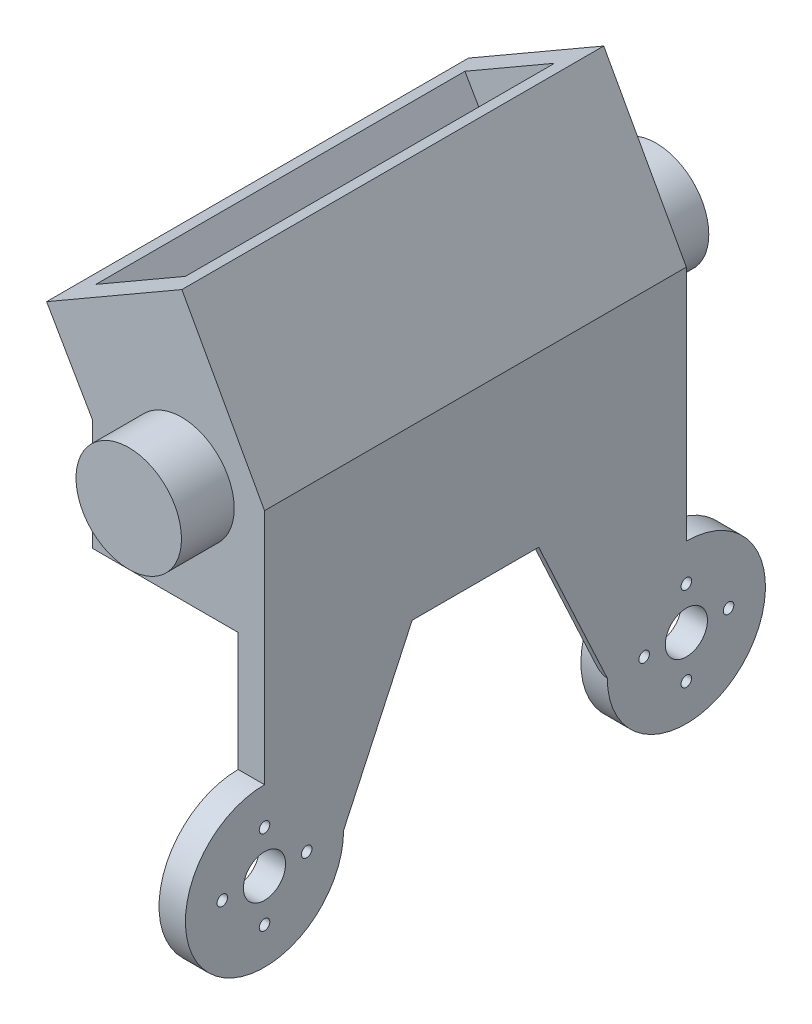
ISO-10303-21;
HEADER;
FILE_DESCRIPTION(('STEP AP214'),'2;1');
FILE_NAME('part.step','',(''),(''),'','','');
FILE_SCHEMA(('AUTOMOTIVE_DESIGN { 1 0 10303 214 1 1 1 1 }'));
ENDSEC;
DATA;
#1=APPLICATION_CONTEXT('core data for automotive mechanical design processes');
#2=APPLICATION_PROTOCOL_DEFINITION('international standard','automotive_design',2000,#1);
#3=PRODUCT_CONTEXT('',#1,'mechanical');
#4=PRODUCT('Part','Part','',(#3));
#5=PRODUCT_RELATED_PRODUCT_CATEGORY('part','',(#4));
#6=PRODUCT_DEFINITION_FORMATION('','',#4);
#7=PRODUCT_DEFINITION_CONTEXT('part definition',#1,'design');
#8=PRODUCT_DEFINITION('design','',#6,#7);
#9=PRODUCT_DEFINITION_SHAPE('','',#8);
#10=(LENGTH_UNIT() NAMED_UNIT(*) SI_UNIT(.MILLI.,.METRE.));
#11=(NAMED_UNIT(*) PLANE_ANGLE_UNIT() SI_UNIT($,.RADIAN.));
#12=(NAMED_UNIT(*) SI_UNIT($,.STERADIAN.) SOLID_ANGLE_UNIT());
#13=UNCERTAINTY_MEASURE_WITH_UNIT(LENGTH_MEASURE(1.E-05),#10,'distance_accuracy_value','');
#14=(GEOMETRIC_REPRESENTATION_CONTEXT(3) GLOBAL_UNCERTAINTY_ASSIGNED_CONTEXT((#13)) GLOBAL_UNIT_ASSIGNED_CONTEXT((#10,
#11,#12)) REPRESENTATION_CONTEXT('',''));
#15=CARTESIAN_POINT('',(0.,0.,0.));
#16=DIRECTION('',(0.,0.,1.));
#17=DIRECTION('',(1.,0.,0.));
#18=AXIS2_PLACEMENT_3D('',#15,#16,#17);
#19=CARTESIAN_POINT('',(0.,0.,0.));
#20=DIRECTION('',(1.,0.,0.));
#21=DIRECTION('',(0.,0.,-1.));
#22=AXIS2_PLACEMENT_3D('',#19,#20,#21);
#23=PLANE('',#22);
#24=DIRECTION('',(0.,-1.,0.));
#25=VECTOR('',#24,1.);
#26=CARTESIAN_POINT('',(0.,61.,-75.));
#27=LINE('',#26,#25);
#28=CARTESIAN_POINT('',(0.,61.,-75.));
#29=VERTEX_POINT('',#28);
#30=CARTESIAN_POINT('',(0.,60.0000000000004,-75.));
#31=VERTEX_POINT('',#30);
#32=EDGE_CURVE('E263',#29,#31,#27,.T.);
#33=ORIENTED_EDGE('',*,*,#32,.T.);
#34=DIRECTION('',(0.,0.,1.));
#35=VECTOR('',#34,1.);
#36=CARTESIAN_POINT('',(0.,60.0000000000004,0.));
#37=LINE('',#36,#35);
#38=CARTESIAN_POINT('',(0.,60.0000000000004,-4.99999999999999));
#39=VERTEX_POINT('',#38);
#40=EDGE_CURVE('E231',#31,#39,#37,.T.);
#41=ORIENTED_EDGE('',*,*,#40,.T.);
#42=DIRECTION('',(0.,-1.,0.));
#43=VECTOR('',#42,1.);
#44=CARTESIAN_POINT('',(0.,61.,-4.99999999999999));
#45=LINE('',#44,#43);
#46=CARTESIAN_POINT('',(0.,61.,-4.99999999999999));
#47=VERTEX_POINT('',#46);
#48=EDGE_CURVE('E203',#47,#39,#45,.T.);
#49=ORIENTED_EDGE('',*,*,#48,.F.);
#50=DIRECTION('',(0.,0.,1.));
#51=VECTOR('',#50,1.);
#52=CARTESIAN_POINT('',(0.,61.,-75.));
#53=LINE('',#52,#51);
#54=EDGE_CURVE('E243',#29,#47,#53,.T.);
#55=ORIENTED_EDGE('',*,*,#54,.F.);
#56=EDGE_LOOP('',(#33,#41,#49,#55));
#57=FACE_BOUND('',#56,.T.);
#58=ADVANCED_FACE('F37',(#57),#23,.F.);
#59=CARTESIAN_POINT('',(5.,0.,-80.));
#60=DIRECTION('',(-1.,0.,0.));
#61=DIRECTION('',(0.,0.,1.));
#62=AXIS2_PLACEMENT_3D('',#59,#60,#61);
#63=CYLINDRICAL_SURFACE('',#62,15.);
#64=CARTESIAN_POINT('',(0.,0.,-80.));
#65=DIRECTION('',(1.,0.,0.));
#66=DIRECTION('',(0.,0.,-1.));
#67=AXIS2_PLACEMENT_3D('',#64,#65,#66);
#68=CIRCLE('',#67,15.);
#69=CARTESIAN_POINT('',(0.,7.52000918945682,-67.0211918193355));
#70=VERTEX_POINT('',#69);
#71=CARTESIAN_POINT('',(0.,15.,-80.));
#72=VERTEX_POINT('',#71);
#73=EDGE_CURVE('E310',#70,#72,#68,.T.);
#74=ORIENTED_EDGE('',*,*,#73,.T.);
#75=DIRECTION('',(-1.,0.,0.));
#76=VECTOR('',#75,1.);
#77=CARTESIAN_POINT('',(5.,15.,-80.));
#78=LINE('',#77,#76);
#79=CARTESIAN_POINT('',(5.,15.,-80.));
#80=VERTEX_POINT('',#79);
#81=EDGE_CURVE('E346',#80,#72,#78,.T.);
#82=ORIENTED_EDGE('',*,*,#81,.F.);
#83=CARTESIAN_POINT('',(5.,0.,-80.));
#84=DIRECTION('',(1.,0.,0.));
#85=DIRECTION('',(0.,0.,-1.));
#86=AXIS2_PLACEMENT_3D('',#83,#84,#85);
#87=CIRCLE('',#86,15.);
#88=CARTESIAN_POINT('',(5.,0.,-65.));
#89=VERTEX_POINT('',#88);
#90=EDGE_CURVE('E311',#89,#80,#87,.T.);
#91=ORIENTED_EDGE('',*,*,#90,.F.);
#92=CARTESIAN_POINT('',(5.,0.,-65.));
#93=CARTESIAN_POINT('',(4.93154830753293,-4.38672861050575E-05,-65.0000043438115));
#94=CARTESIAN_POINT('',(4.8631235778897,0.00333661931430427,-65.0000000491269));
#95=CARTESIAN_POINT('',(4.72702251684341,0.0166023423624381,-65.0000065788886));
#96=CARTESIAN_POINT('',(4.65934509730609,0.0264763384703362,-65.0000173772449));
#97=CARTESIAN_POINT('',(4.52621391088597,0.0521900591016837,-65.0000857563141));
#98=CARTESIAN_POINT('',(4.46074197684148,0.0679366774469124,-65.0001426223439));
#99=CARTESIAN_POINT('',(4.33133995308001,0.104867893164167,-65.0003550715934));
#100=CARTESIAN_POINT('',(4.26741062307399,0.126055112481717,-65.0005107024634));
#101=CARTESIAN_POINT('',(4.0356766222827,0.212892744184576,-65.0013786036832));
#102=CARTESIAN_POINT('',(3.87340619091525,0.293536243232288,-65.0025866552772));
#103=CARTESIAN_POINT('',(3.56248540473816,0.478941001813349,-65.0073603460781));
#104=CARTESIAN_POINT('',(3.41394529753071,0.583877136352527,-65.0109434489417));
#105=CARTESIAN_POINT('',(3.14078631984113,0.801072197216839,-65.0210405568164));
#106=CARTESIAN_POINT('',(3.01520668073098,0.91215508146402,-65.0273091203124));
#107=CARTESIAN_POINT('',(2.7736359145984,1.14415523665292,-65.0432473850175));
#108=CARTESIAN_POINT('',(2.65765304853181,1.26508080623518,-65.0529199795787));
#109=CARTESIAN_POINT('',(2.43400257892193,1.51432816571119,-65.0761093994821));
#110=CARTESIAN_POINT('',(2.32634802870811,1.64266103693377,-65.0896321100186));
#111=CARTESIAN_POINT('',(2.11866153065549,1.90488567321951,-65.1208577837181));
#112=CARTESIAN_POINT('',(2.01863182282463,2.03877905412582,-65.1385619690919));
#113=CARTESIAN_POINT('',(1.76658293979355,2.39411463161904,-65.1906364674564));
#114=CARTESIAN_POINT('',(1.62016901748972,2.61903402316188,-65.2285784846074));
#115=CARTESIAN_POINT('',(1.34437542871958,3.07678232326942,-65.3170894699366));
#116=CARTESIAN_POINT('',(1.21500439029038,3.30961516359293,-65.3676647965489));
#117=CARTESIAN_POINT('',(0.973668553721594,3.78016525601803,-65.4821205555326));
#118=CARTESIAN_POINT('',(0.8616585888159,4.01786794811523,-65.5459654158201));
#119=CARTESIAN_POINT('',(0.655501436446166,4.49678703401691,-65.6877235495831));
#120=CARTESIAN_POINT('',(0.561351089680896,4.73800279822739,-65.7656343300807));
#121=CARTESIAN_POINT('',(0.402811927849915,5.19250196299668,-65.9256027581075));
#122=CARTESIAN_POINT('',(0.336191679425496,5.40559433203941,-66.0059884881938));
#123=CARTESIAN_POINT('',(0.219429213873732,5.8316158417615,-66.1780968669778));
#124=CARTESIAN_POINT('',(0.169278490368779,6.0445450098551,-66.2698136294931));
#125=CARTESIAN_POINT('',(0.0870085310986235,6.46994695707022,-66.4650531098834));
#126=CARTESIAN_POINT('',(0.0549837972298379,6.68241169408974,-66.5686343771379));
#127=CARTESIAN_POINT('',(0.022353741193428,6.99861228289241,-66.7322356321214));
#128=CARTESIAN_POINT('',(0.0140443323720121,7.10369819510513,-66.7881998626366));
#129=CARTESIAN_POINT('',(0.00286770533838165,7.31275611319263,-66.9027552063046));
#130=CARTESIAN_POINT('',(1.96588662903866E-06,7.4167278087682,-66.9613470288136));
#131=CARTESIAN_POINT('',(0.,7.52000918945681,-67.0211918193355));
#132=B_SPLINE_CURVE_WITH_KNOTS('',3,(#92,#93,#94,#95,#96,#97,#98,#99,#100,#101,#102,#103,#104,
#105,#106,#107,#108,#109,#110,#111,#112,#113,#114,#115,#116,#117,#118,#119,#120,#121,#122,#123,
#124,#125,#126,#127,#128,#129,#130,#131),.UNSPECIFIED.,.F.,.F.,(4,2,2,2,2,2,2,2,2,2,2,2,2,2,2,2,
2,2,2,4),(0.,0.205228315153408,0.410102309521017,0.611857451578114,0.813710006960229,
1.3539649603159,1.89823711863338,2.40083205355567,2.90385521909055,3.40765146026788,
3.91159513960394,4.7236464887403,5.53610737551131,6.34641773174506,7.15658461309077,
7.86768828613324,8.57842410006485,9.29283206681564,9.6507385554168,10.0087422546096),.UNSPECIFIED.);
#133=EDGE_CURVE('E380',#89,#70,#132,.T.);
#134=ORIENTED_EDGE('',*,*,#133,.T.);
#135=EDGE_LOOP('',(#74,#82,#91,#134));
#136=FACE_BOUND('',#135,.T.);
#137=ADVANCED_FACE('F374',(#136),#63,.T.);
#138=CARTESIAN_POINT('',(5.,0.,-80.));
#139=DIRECTION('',(0.,0.,1.));
#140=DIRECTION('',(1.,0.,0.));
#141=AXIS2_PLACEMENT_3D('',#138,#139,#140);
#142=PLANE('',#141);
#143=CARTESIAN_POINT('',(-10.7449740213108,57.5,-80.));
#144=DIRECTION('',(0.,0.,1.));
#145=DIRECTION('',(1.,0.,0.));
#146=AXIS2_PLACEMENT_3D('',#143,#144,#145);
#147=CIRCLE('',#146,10.);
#148=CARTESIAN_POINT('',(-0.744974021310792,57.5,-80.));
#149=VERTEX_POINT('',#148);
#150=EDGE_CURVE('E352',#149,#149,#147,.F.);
#151=ORIENTED_EDGE('',*,*,#150,.F.);
#152=EDGE_LOOP('',(#151));
#153=FACE_BOUND('',#152,.T.);
#154=DIRECTION('',(0.,1.,0.));
#155=VECTOR('',#154,1.);
#156=CARTESIAN_POINT('',(0.,0.,-80.));
#157=LINE('',#156,#155);
#158=CARTESIAN_POINT('',(0.,37.5,-80.));
#159=VERTEX_POINT('',#158);
#160=EDGE_CURVE('E338',#72,#159,#157,.T.);
#161=ORIENTED_EDGE('',*,*,#160,.T.);
#162=DIRECTION('',(-1.,0.,0.));
#163=VECTOR('',#162,1.);
#164=CARTESIAN_POINT('',(0.,37.5,-80.));
#165=LINE('',#164,#163);
#166=CARTESIAN_POINT('',(-27.655685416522,37.5,-80.));
#167=VERTEX_POINT('',#166);
#168=EDGE_CURVE('E260',#159,#167,#165,.T.);
#169=ORIENTED_EDGE('',*,*,#168,.T.);
#170=DIRECTION('',(0.,1.,0.));
#171=VECTOR('',#170,1.);
#172=CARTESIAN_POINT('',(-27.655685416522,37.5,-80.));
#173=LINE('',#172,#171);
#174=CARTESIAN_POINT('',(-27.655685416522,58.6605665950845,-80.));
#175=VERTEX_POINT('',#174);
#176=EDGE_CURVE('E281',#167,#175,#173,.T.);
#177=ORIENTED_EDGE('',*,*,#176,.T.);
#178=DIRECTION('',(-0.5,0.866025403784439,0.));
#179=VECTOR('',#178,1.);
#180=CARTESIAN_POINT('',(-27.655685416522,58.6605665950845,-80.));
#181=LINE('',#180,#179);
#182=CARTESIAN_POINT('',(-36.3217557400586,73.6706406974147,-80.));
#183=VERTEX_POINT('',#182);
#184=EDGE_CURVE('E272',#175,#183,#181,.T.);
#185=ORIENTED_EDGE('',*,*,#184,.T.);
#186=DIRECTION('',(0.86602540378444,0.499999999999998,0.));
#187=VECTOR('',#186,1.);
#188=CARTESIAN_POINT('',(-15.,85.9807621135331,-80.));
#189=LINE('',#188,#187);
#190=CARTESIAN_POINT('',(-10.6698729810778,88.4807621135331,-80.));
#191=VERTEX_POINT('',#190);
#192=EDGE_CURVE('E289',#183,#191,#189,.T.);
#193=ORIENTED_EDGE('',*,*,#192,.T.);
#194=DIRECTION('',(0.482047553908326,-0.876145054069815,0.));
#195=VECTOR('',#194,1.);
#196=CARTESIAN_POINT('',(-10.6698729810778,88.4807621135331,-80.));
#197=LINE('',#196,#195);
#198=CARTESIAN_POINT('',(5.,60.,-80.));
#199=VERTEX_POINT('',#198);
#200=EDGE_CURVE('E301',#191,#199,#197,.T.);
#201=ORIENTED_EDGE('',*,*,#200,.T.);
#202=DIRECTION('',(0.,1.,0.));
#203=VECTOR('',#202,1.);
#204=CARTESIAN_POINT('',(5.,0.,-80.));
#205=LINE('',#204,#203);
#206=EDGE_CURVE('E314',#80,#199,#205,.T.);
#207=ORIENTED_EDGE('',*,*,#206,.F.);
#208=ORIENTED_EDGE('',*,*,#81,.T.);
#209=EDGE_LOOP('',(#161,#169,#177,#185,#193,#201,#207,#208));
#210=FACE_BOUND('',#209,.T.);
#211=ADVANCED_FACE('F436',(#153,#210),#142,.F.);
#212=CARTESIAN_POINT('',(5.,0.,0.));
#213=DIRECTION('',(0.,0.,1.));
#214=DIRECTION('',(1.,0.,0.));
#215=AXIS2_PLACEMENT_3D('',#212,#213,#214);
#216=PLANE('',#215);
#217=CARTESIAN_POINT('',(-10.7449740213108,57.5,0.));
#218=DIRECTION('',(0.,0.,1.));
#219=DIRECTION('',(1.,0.,0.));
#220=AXIS2_PLACEMENT_3D('',#217,#218,#219);
#221=CIRCLE('',#220,10.);
#222=CARTESIAN_POINT('',(-0.744974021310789,57.5,0.));
#223=VERTEX_POINT('',#222);
#224=EDGE_CURVE('E520',#223,#223,#221,.T.);
#225=ORIENTED_EDGE('',*,*,#224,.F.);
#226=EDGE_LOOP('',(#225));
#227=FACE_BOUND('',#226,.T.);
#228=DIRECTION('',(-1.,0.,0.));
#229=VECTOR('',#228,1.);
#230=CARTESIAN_POINT('',(0.,37.5,0.));
#231=LINE('',#230,#229);
#232=CARTESIAN_POINT('',(0.,37.5,0.));
#233=VERTEX_POINT('',#232);
#234=CARTESIAN_POINT('',(-27.655685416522,37.5,0.));
#235=VERTEX_POINT('',#234);
#236=EDGE_CURVE('E268',#233,#235,#231,.T.);
#237=ORIENTED_EDGE('',*,*,#236,.F.);
#238=DIRECTION('',(0.,1.,0.));
#239=VECTOR('',#238,1.);
#240=CARTESIAN_POINT('',(0.,0.,0.));
#241=LINE('',#240,#239);
#242=CARTESIAN_POINT('',(0.,15.,0.));
#243=VERTEX_POINT('',#242);
#244=EDGE_CURVE('E341',#243,#233,#241,.T.);
#245=ORIENTED_EDGE('',*,*,#244,.F.);
#246=DIRECTION('',(-1.,0.,0.));
#247=VECTOR('',#246,1.);
#248=CARTESIAN_POINT('',(5.,15.,0.));
#249=LINE('',#248,#247);
#250=CARTESIAN_POINT('',(5.,15.,0.));
#251=VERTEX_POINT('',#250);
#252=EDGE_CURVE('E335',#251,#243,#249,.T.);
#253=ORIENTED_EDGE('',*,*,#252,.F.);
#254=DIRECTION('',(0.,1.,0.));
#255=VECTOR('',#254,1.);
#256=CARTESIAN_POINT('',(5.,0.,0.));
#257=LINE('',#256,#255);
#258=CARTESIAN_POINT('',(5.,60.,0.));
#259=VERTEX_POINT('',#258);
#260=EDGE_CURVE('E320',#251,#259,#257,.T.);
#261=ORIENTED_EDGE('',*,*,#260,.T.);
#262=DIRECTION('',(0.482047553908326,-0.876145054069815,0.));
#263=VECTOR('',#262,1.);
#264=CARTESIAN_POINT('',(-10.6698729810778,88.4807621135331,0.));
#265=LINE('',#264,#263);
#266=CARTESIAN_POINT('',(-10.6698729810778,88.4807621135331,0.));
#267=VERTEX_POINT('',#266);
#268=EDGE_CURVE('E300',#267,#259,#265,.T.);
#269=ORIENTED_EDGE('',*,*,#268,.F.);
#270=DIRECTION('',(0.86602540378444,0.499999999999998,0.));
#271=VECTOR('',#270,1.);
#272=CARTESIAN_POINT('',(-15.,85.9807621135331,0.));
#273=LINE('',#272,#271);
#274=CARTESIAN_POINT('',(-36.3217557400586,73.6706406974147,0.));
#275=VERTEX_POINT('',#274);
#276=EDGE_CURVE('E297',#275,#267,#273,.T.);
#277=ORIENTED_EDGE('',*,*,#276,.F.);
#278=DIRECTION('',(-0.5,0.866025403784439,0.));
#279=VECTOR('',#278,1.);
#280=CARTESIAN_POINT('',(-27.655685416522,58.6605665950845,0.));
#281=LINE('',#280,#279);
#282=CARTESIAN_POINT('',(-27.655685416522,58.6605665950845,0.));
#283=VERTEX_POINT('',#282);
#284=EDGE_CURVE('E275',#283,#275,#281,.T.);
#285=ORIENTED_EDGE('',*,*,#284,.F.);
#286=DIRECTION('',(0.,1.,0.));
#287=VECTOR('',#286,1.);
#288=CARTESIAN_POINT('',(-27.655685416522,37.5,0.));
#289=LINE('',#288,#287);
#290=EDGE_CURVE('E271',#235,#283,#289,.T.);
#291=ORIENTED_EDGE('',*,*,#290,.F.);
#292=EDGE_LOOP('',(#237,#245,#253,#261,#269,#277,#285,#291));
#293=FACE_BOUND('',#292,.T.);
#294=ADVANCED_FACE('F398',(#227,#293),#216,.T.);
#295=CARTESIAN_POINT('',(5.,0.,0.));
#296=DIRECTION('',(-1.,0.,0.));
#297=DIRECTION('',(0.,0.,1.));
#298=AXIS2_PLACEMENT_3D('',#295,#296,#297);
#299=CYLINDRICAL_SURFACE('',#298,15.);
#300=CARTESIAN_POINT('',(0.,0.,0.));
#301=DIRECTION('',(1.,0.,0.));
#302=DIRECTION('',(0.,0.,-1.));
#303=AXIS2_PLACEMENT_3D('',#300,#301,#302);
#304=CIRCLE('',#303,15.);
#305=CARTESIAN_POINT('',(0.,7.52000918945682,-12.9788081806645));
#306=VERTEX_POINT('',#305);
#307=EDGE_CURVE('E315',#243,#306,#304,.T.);
#308=ORIENTED_EDGE('',*,*,#307,.T.);
#309=CARTESIAN_POINT('',(0.,7.52000918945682,-12.9788081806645));
#310=CARTESIAN_POINT('',(1.62481452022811E-05,7.33554410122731,-13.0857304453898));
#311=CARTESIAN_POINT('',(0.0091476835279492,7.14888493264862,-13.1885880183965));
#312=CARTESIAN_POINT('',(0.0440515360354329,6.77284707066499,-13.3855606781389));
#313=CARTESIAN_POINT('',(0.0698006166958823,6.58347255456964,-13.4796878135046));
#314=CARTESIAN_POINT('',(0.136228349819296,6.20389552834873,-13.6585364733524));
#315=CARTESIAN_POINT('',(0.176847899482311,6.01369920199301,-13.7432935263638));
#316=CARTESIAN_POINT('',(0.271697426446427,5.63280662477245,-13.9037479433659));
#317=CARTESIAN_POINT('',(0.325933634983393,5.44211018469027,-13.9794411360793));
#318=CARTESIAN_POINT('',(0.462185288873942,5.01302129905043,-14.1398204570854));
#319=CARTESIAN_POINT('',(0.54775741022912,4.77478910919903,-14.2219241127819));
#320=CARTESIAN_POINT('',(0.736717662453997,4.30102191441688,-14.3723000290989));
#321=CARTESIAN_POINT('',(0.840110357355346,4.06548761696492,-14.4405687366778));
#322=CARTESIAN_POINT('',(1.06384001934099,3.59844696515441,-14.5639844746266));
#323=CARTESIAN_POINT('',(1.18421254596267,3.36695023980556,-14.619103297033));
#324=CARTESIAN_POINT('',(1.44134136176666,2.91058470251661,-14.7167545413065));
#325=CARTESIAN_POINT('',(1.57809039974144,2.68571301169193,-14.7592925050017));
#326=CARTESIAN_POINT('',(1.81083218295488,2.33286997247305,-14.8180916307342));
#327=CARTESIAN_POINT('',(1.9014126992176,2.20191868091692,-14.8380759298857));
#328=CARTESIAN_POINT('',(2.08911663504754,1.94423441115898,-14.874032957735));
#329=CARTESIAN_POINT('',(2.18623878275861,1.81750062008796,-14.8900064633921));
#330=CARTESIAN_POINT('',(2.3873972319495,1.56958753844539,-14.9181741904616));
#331=CARTESIAN_POINT('',(2.4914197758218,1.44839796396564,-14.9303756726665));
#332=CARTESIAN_POINT('',(2.70731317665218,1.21295862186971,-14.9513441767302));
#333=CARTESIAN_POINT('',(2.81918062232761,1.09870587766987,-14.9601126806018));
#334=CARTESIAN_POINT('',(3.07364151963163,0.858870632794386,-14.9759575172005));
#335=CARTESIAN_POINT('',(3.21806933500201,0.735163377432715,-14.9824110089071));
#336=CARTESIAN_POINT('',(3.52170813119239,0.506902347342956,-14.9918658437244));
#337=CARTESIAN_POINT('',(3.68090375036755,0.402328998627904,-14.9948707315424));
#338=CARTESIAN_POINT('',(3.96925057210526,0.247198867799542,-14.9981065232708));
#339=CARTESIAN_POINT('',(4.09460547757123,0.189697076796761,-14.9988734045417));
#340=CARTESIAN_POINT('',(4.35270684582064,0.0953790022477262,-14.9997720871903));
#341=CARTESIAN_POINT('',(4.48542469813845,0.0584880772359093,-14.9999061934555));
#342=CARTESIAN_POINT('',(4.68286688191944,0.0229354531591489,-14.9999864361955));
#343=CARTESIAN_POINT('',(4.74588768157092,0.0143818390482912,-14.9999948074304));
#344=CARTESIAN_POINT('',(4.87259108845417,0.0028963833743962,-15.0000002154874));
#345=CARTESIAN_POINT('',(4.93627493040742,-2.17680950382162E-05,-14.9999972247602));
#346=CARTESIAN_POINT('',(5.,0.,-15.));
#347=B_SPLINE_CURVE_WITH_KNOTS('',3,(#309,#310,#311,#312,#313,#314,#315,#316,#317,#318,#319,
#320,#321,#322,#323,#324,#325,#326,#327,#328,#329,#330,#331,#332,#333,#334,#335,#336,#337,#338,
#339,#340,#341,#342,#343,#344,#345,#346),.UNSPECIFIED.,.F.,.F.,(4,2,2,2,2,2,2,2,2,2,2,2,2,2,2,2,
2,2,4),(0.,0.639192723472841,1.27748976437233,1.91327695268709,2.54935562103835,
3.34663621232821,4.1441212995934,4.94330200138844,5.74213014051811,6.22335766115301,
6.70449188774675,7.18469412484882,7.66468882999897,8.23442122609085,8.80356748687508,
9.21600728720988,9.62694360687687,9.81751437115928,10.0085475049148),.UNSPECIFIED.);
#348=CARTESIAN_POINT('',(5.,0.,-15.));
#349=VERTEX_POINT('',#348);
#350=EDGE_CURVE('E356',#306,#349,#347,.T.);
#351=ORIENTED_EDGE('',*,*,#350,.T.);
#352=CARTESIAN_POINT('',(5.,0.,0.));
#353=DIRECTION('',(1.,0.,0.));
#354=DIRECTION('',(0.,0.,-1.));
#355=AXIS2_PLACEMENT_3D('',#352,#353,#354);
#356=CIRCLE('',#355,15.);
#357=EDGE_CURVE('E323',#251,#349,#356,.T.);
#358=ORIENTED_EDGE('',*,*,#357,.F.);
#359=ORIENTED_EDGE('',*,*,#252,.T.);
#360=EDGE_LOOP('',(#308,#351,#358,#359));
#361=FACE_BOUND('',#360,.T.);
#362=ADVANCED_FACE('F364',(#361),#299,.T.);
#363=CARTESIAN_POINT('',(5.,0.,0.));
#364=DIRECTION('',(1.,0.,0.));
#365=DIRECTION('',(0.,0.,-1.));
#366=AXIS2_PLACEMENT_3D('',#363,#364,#365);
#367=PLANE('',#366);
#368=CARTESIAN_POINT('',(5.,0.,-88.));
#369=DIRECTION('',(1.,0.,0.));
#370=DIRECTION('',(0.,0.,-1.));
#371=AXIS2_PLACEMENT_3D('',#368,#369,#370);
#372=CIRCLE('',#371,1.);
#373=CARTESIAN_POINT('',(5.,0.,-89.));
#374=VERTEX_POINT('',#373);
#375=EDGE_CURVE('E860',#374,#374,#372,.F.);
#376=ORIENTED_EDGE('',*,*,#375,.T.);
#377=EDGE_LOOP('',(#376));
#378=FACE_BOUND('',#377,.T.);
#379=CARTESIAN_POINT('',(5.,8.,-80.0000000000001));
#380=DIRECTION('',(1.,0.,0.));
#381=DIRECTION('',(0.,0.,-1.));
#382=AXIS2_PLACEMENT_3D('',#379,#380,#381);
#383=CIRCLE('',#382,1.);
#384=CARTESIAN_POINT('',(5.,8.,-81.0000000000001));
#385=VERTEX_POINT('',#384);
#386=EDGE_CURVE('E861',#385,#385,#383,.F.);
#387=ORIENTED_EDGE('',*,*,#386,.T.);
#388=EDGE_LOOP('',(#387));
#389=FACE_BOUND('',#388,.T.);
#390=CARTESIAN_POINT('',(5.,0.,-72.));
#391=DIRECTION('',(1.,0.,0.));
#392=DIRECTION('',(0.,0.,-1.));
#393=AXIS2_PLACEMENT_3D('',#390,#391,#392);
#394=CIRCLE('',#393,1.);
#395=CARTESIAN_POINT('',(5.,0.,-73.));
#396=VERTEX_POINT('',#395);
#397=EDGE_CURVE('E874',#396,#396,#394,.F.);
#398=ORIENTED_EDGE('',*,*,#397,.T.);
#399=EDGE_LOOP('',(#398));
#400=FACE_BOUND('',#399,.T.);
#401=CARTESIAN_POINT('',(5.,0.,-80.));
#402=DIRECTION('',(1.,0.,0.));
#403=DIRECTION('',(0.,0.,-1.));
#404=AXIS2_PLACEMENT_3D('',#401,#402,#403);
#405=CIRCLE('',#404,4.00000000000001);
#406=CARTESIAN_POINT('',(5.,0.,-84.));
#407=VERTEX_POINT('',#406);
#408=EDGE_CURVE('E870',#407,#407,#405,.F.);
#409=ORIENTED_EDGE('',*,*,#408,.T.);
#410=EDGE_LOOP('',(#409));
#411=FACE_BOUND('',#410,.T.);
#412=CARTESIAN_POINT('',(5.,-8.,-80.));
#413=DIRECTION('',(1.,0.,0.));
#414=DIRECTION('',(0.,0.,-1.));
#415=AXIS2_PLACEMENT_3D('',#412,#413,#414);
#416=CIRCLE('',#415,0.999999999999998);
#417=CARTESIAN_POINT('',(5.,-8.,-81.));
#418=VERTEX_POINT('',#417);
#419=EDGE_CURVE('E869',#418,#418,#416,.F.);
#420=ORIENTED_EDGE('',*,*,#419,.T.);
#421=EDGE_LOOP('',(#420));
#422=FACE_BOUND('',#421,.T.);
#423=CARTESIAN_POINT('',(5.,8.,0.));
#424=DIRECTION('',(1.,0.,0.));
#425=DIRECTION('',(0.,0.,-1.));
#426=AXIS2_PLACEMENT_3D('',#423,#424,#425);
#427=CIRCLE('',#426,1.);
#428=CARTESIAN_POINT('',(5.,8.,-0.999999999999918));
#429=VERTEX_POINT('',#428);
#430=EDGE_CURVE('E878',#429,#429,#427,.F.);
#431=ORIENTED_EDGE('',*,*,#430,.T.);
#432=EDGE_LOOP('',(#431));
#433=FACE_BOUND('',#432,.T.);
#434=CARTESIAN_POINT('',(5.,0.,-8.));
#435=DIRECTION('',(1.,0.,0.));
#436=DIRECTION('',(0.,0.,-1.));
#437=AXIS2_PLACEMENT_3D('',#434,#435,#436);
#438=CIRCLE('',#437,1.);
#439=CARTESIAN_POINT('',(5.,0.,-9.));
#440=VERTEX_POINT('',#439);
#441=EDGE_CURVE('E882',#440,#440,#438,.F.);
#442=ORIENTED_EDGE('',*,*,#441,.T.);
#443=EDGE_LOOP('',(#442));
#444=FACE_BOUND('',#443,.T.);
#445=CARTESIAN_POINT('',(5.,-8.,0.));
#446=DIRECTION('',(1.,0.,0.));
#447=DIRECTION('',(0.,0.,-1.));
#448=AXIS2_PLACEMENT_3D('',#445,#446,#447);
#449=CIRCLE('',#448,1.);
#450=CARTESIAN_POINT('',(5.,-8.,-1.00000000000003));
#451=VERTEX_POINT('',#450);
#452=EDGE_CURVE('E525',#451,#451,#449,.F.);
#453=ORIENTED_EDGE('',*,*,#452,.T.);
#454=EDGE_LOOP('',(#453));
#455=FACE_BOUND('',#454,.T.);
#456=CARTESIAN_POINT('',(5.,0.,0.));
#457=DIRECTION('',(1.,0.,0.));
#458=DIRECTION('',(0.,0.,-1.));
#459=AXIS2_PLACEMENT_3D('',#456,#457,#458);
#460=CIRCLE('',#459,4.);
#461=CARTESIAN_POINT('',(5.,0.,-4.));
#462=VERTEX_POINT('',#461);
#463=EDGE_CURVE('E889',#462,#462,#460,.F.);
#464=ORIENTED_EDGE('',*,*,#463,.T.);
#465=EDGE_LOOP('',(#464));
#466=FACE_BOUND('',#465,.T.);
#467=CARTESIAN_POINT('',(5.,0.,8.));
#468=DIRECTION('',(1.,0.,0.));
#469=DIRECTION('',(0.,0.,-1.));
#470=AXIS2_PLACEMENT_3D('',#467,#468,#469);
#471=CIRCLE('',#470,1.);
#472=CARTESIAN_POINT('',(5.,0.,7.));
#473=VERTEX_POINT('',#472);
#474=EDGE_CURVE('E517',#473,#473,#471,.F.);
#475=ORIENTED_EDGE('',*,*,#474,.T.);
#476=EDGE_LOOP('',(#475));
#477=FACE_BOUND('',#476,.T.);
#478=ORIENTED_EDGE('',*,*,#90,.T.);
#479=ORIENTED_EDGE('',*,*,#206,.T.);
#480=DIRECTION('',(0.,0.,-1.));
#481=VECTOR('',#480,1.);
#482=CARTESIAN_POINT('',(5.,60.,0.));
#483=LINE('',#482,#481);
#484=EDGE_CURVE('E317',#259,#199,#483,.T.);
#485=ORIENTED_EDGE('',*,*,#484,.F.);
#486=ORIENTED_EDGE('',*,*,#260,.F.);
#487=ORIENTED_EDGE('',*,*,#357,.T.);
#488=DIRECTION('',(0.,-0.907008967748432,0.421111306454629));
#489=VECTOR('',#488,1.);
#490=CARTESIAN_POINT('',(5.,-5.7292759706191,-12.3399790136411));
#491=LINE('',#490,#489);
#492=CARTESIAN_POINT('',(5.,28.,-28.));
#493=VERTEX_POINT('',#492);
#494=EDGE_CURVE('E326',#493,#349,#491,.T.);
#495=ORIENTED_EDGE('',*,*,#494,.F.);
#496=DIRECTION('',(0.,0.,-1.));
#497=VECTOR('',#496,1.);
#498=CARTESIAN_POINT('',(5.,28.,0.));
#499=LINE('',#498,#497);
#500=CARTESIAN_POINT('',(5.,28.,-52.));
#501=VERTEX_POINT('',#500);
#502=EDGE_CURVE('E329',#493,#501,#499,.T.);
#503=ORIENTED_EDGE('',*,*,#502,.T.);
#504=DIRECTION('',(0.,-0.907008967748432,-0.421111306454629));
#505=VECTOR('',#504,1.);
#506=CARTESIAN_POINT('',(5.,24.8268625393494,-53.4732423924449));
#507=LINE('',#506,#505);
#508=EDGE_CURVE('E332',#501,#89,#507,.T.);
#509=ORIENTED_EDGE('',*,*,#508,.T.);
#510=EDGE_LOOP('',(#478,#479,#485,#486,#487,#495,#503,#509));
#511=FACE_BOUND('',#510,.T.);
#512=ADVANCED_FACE('F441',(#378,#389,#400,#411,#422,#433,#444,#455,#466,#477,#511),#367,.T.);
#513=CARTESIAN_POINT('',(0.,0.,-88.));
#514=DIRECTION('',(-1.,0.,0.));
#515=DIRECTION('',(0.,0.,1.));
#516=AXIS2_PLACEMENT_3D('',#513,#514,#515);
#517=CIRCLE('',#516,1.);
#518=CARTESIAN_POINT('',(0.,0.,-87.));
#519=VERTEX_POINT('',#518);
#520=EDGE_CURVE('E479',#519,#519,#517,.T.);
#521=ORIENTED_EDGE('',*,*,#520,.F.);
#522=EDGE_LOOP('',(#521));
#523=FACE_BOUND('',#522,.T.);
#524=CARTESIAN_POINT('',(0.,8.,-80.0000000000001));
#525=DIRECTION('',(-1.,0.,0.));
#526=DIRECTION('',(0.,0.,1.));
#527=AXIS2_PLACEMENT_3D('',#524,#525,#526);
#528=CIRCLE('',#527,1.);
#529=CARTESIAN_POINT('',(0.,8.,-79.0000000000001));
#530=VERTEX_POINT('',#529);
#531=EDGE_CURVE('E483',#530,#530,#528,.T.);
#532=ORIENTED_EDGE('',*,*,#531,.F.);
#533=EDGE_LOOP('',(#532));
#534=FACE_BOUND('',#533,.T.);
#535=CARTESIAN_POINT('',(0.,0.,-72.));
#536=DIRECTION('',(-1.,0.,0.));
#537=DIRECTION('',(0.,0.,1.));
#538=AXIS2_PLACEMENT_3D('',#535,#536,#537);
#539=CIRCLE('',#538,1.);
#540=CARTESIAN_POINT('',(0.,0.,-71.));
#541=VERTEX_POINT('',#540);
#542=EDGE_CURVE('E487',#541,#541,#539,.T.);
#543=ORIENTED_EDGE('',*,*,#542,.F.);
#544=EDGE_LOOP('',(#543));
#545=FACE_BOUND('',#544,.T.);
#546=CARTESIAN_POINT('',(0.,0.,-80.));
#547=DIRECTION('',(-1.,0.,0.));
#548=DIRECTION('',(0.,0.,1.));
#549=AXIS2_PLACEMENT_3D('',#546,#547,#548);
#550=CIRCLE('',#549,4.00000000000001);
#551=CARTESIAN_POINT('',(0.,0.,-76.));
#552=VERTEX_POINT('',#551);
#553=EDGE_CURVE('E491',#552,#552,#550,.T.);
#554=ORIENTED_EDGE('',*,*,#553,.F.);
#555=EDGE_LOOP('',(#554));
#556=FACE_BOUND('',#555,.T.);
#557=CARTESIAN_POINT('',(0.,-8.,-80.));
#558=DIRECTION('',(-1.,0.,0.));
#559=DIRECTION('',(0.,0.,1.));
#560=AXIS2_PLACEMENT_3D('',#557,#558,#559);
#561=CIRCLE('',#560,0.999999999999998);
#562=CARTESIAN_POINT('',(0.,-8.,-79.));
#563=VERTEX_POINT('',#562);
#564=EDGE_CURVE('E495',#563,#563,#561,.T.);
#565=ORIENTED_EDGE('',*,*,#564,.F.);
#566=EDGE_LOOP('',(#565));
#567=FACE_BOUND('',#566,.T.);
#568=CARTESIAN_POINT('',(0.,8.,0.));
#569=DIRECTION('',(-1.,0.,0.));
#570=DIRECTION('',(0.,0.,1.));
#571=AXIS2_PLACEMENT_3D('',#568,#569,#570);
#572=CIRCLE('',#571,1.);
#573=CARTESIAN_POINT('',(0.,8.,1.00000000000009));
#574=VERTEX_POINT('',#573);
#575=EDGE_CURVE('E499',#574,#574,#572,.T.);
#576=ORIENTED_EDGE('',*,*,#575,.F.);
#577=EDGE_LOOP('',(#576));
#578=FACE_BOUND('',#577,.T.);
#579=CARTESIAN_POINT('',(0.,0.,-8.));
#580=DIRECTION('',(-1.,0.,0.));
#581=DIRECTION('',(0.,0.,1.));
#582=AXIS2_PLACEMENT_3D('',#579,#580,#581);
#583=CIRCLE('',#582,1.);
#584=CARTESIAN_POINT('',(0.,0.,-7.));
#585=VERTEX_POINT('',#584);
#586=EDGE_CURVE('E503',#585,#585,#583,.T.);
#587=ORIENTED_EDGE('',*,*,#586,.F.);
#588=EDGE_LOOP('',(#587));
#589=FACE_BOUND('',#588,.T.);
#590=CARTESIAN_POINT('',(0.,-8.,0.));
#591=DIRECTION('',(-1.,0.,0.));
#592=DIRECTION('',(0.,0.,1.));
#593=AXIS2_PLACEMENT_3D('',#590,#591,#592);
#594=CIRCLE('',#593,1.);
#595=CARTESIAN_POINT('',(0.,-8.,0.999999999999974));
#596=VERTEX_POINT('',#595);
#597=EDGE_CURVE('E507',#596,#596,#594,.T.);
#598=ORIENTED_EDGE('',*,*,#597,.F.);
#599=EDGE_LOOP('',(#598));
#600=FACE_BOUND('',#599,.T.);
#601=CARTESIAN_POINT('',(0.,0.,0.));
#602=DIRECTION('',(-1.,0.,0.));
#603=DIRECTION('',(0.,0.,1.));
#604=AXIS2_PLACEMENT_3D('',#601,#602,#603);
#605=CIRCLE('',#604,4.);
#606=CARTESIAN_POINT('',(0.,0.,4.));
#607=VERTEX_POINT('',#606);
#608=EDGE_CURVE('E511',#607,#607,#605,.T.);
#609=ORIENTED_EDGE('',*,*,#608,.F.);
#610=EDGE_LOOP('',(#609));
#611=FACE_BOUND('',#610,.T.);
#612=CARTESIAN_POINT('',(0.,0.,8.));
#613=DIRECTION('',(-1.,0.,0.));
#614=DIRECTION('',(0.,0.,1.));
#615=AXIS2_PLACEMENT_3D('',#612,#613,#614);
#616=CIRCLE('',#615,1.);
#617=CARTESIAN_POINT('',(0.,0.,9.));
#618=VERTEX_POINT('',#617);
#619=EDGE_CURVE('E514',#618,#618,#616,.T.);
#620=ORIENTED_EDGE('',*,*,#619,.F.);
#621=EDGE_LOOP('',(#620));
#622=FACE_BOUND('',#621,.T.);
#623=DIRECTION('',(0.,-0.907008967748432,-0.421111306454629));
#624=VECTOR('',#623,1.);
#625=CARTESIAN_POINT('',(0.,26.9324190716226,-58.0082872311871));
#626=LINE('',#625,#624);
#627=CARTESIAN_POINT('',(0.,33.,-55.191196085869));
#628=VERTEX_POINT('',#627);
#629=EDGE_CURVE('E52',#70,#628,#626,.F.);
#630=ORIENTED_EDGE('',*,*,#629,.T.);
#631=DIRECTION('',(0.,0.,-1.));
#632=VECTOR('',#631,1.);
#633=CARTESIAN_POINT('',(0.,33.,0.));
#634=LINE('',#633,#632);
#635=CARTESIAN_POINT('',(0.,33.,-24.808803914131));
#636=VERTEX_POINT('',#635);
#637=EDGE_CURVE('E386',#628,#636,#634,.F.);
#638=ORIENTED_EDGE('',*,*,#637,.T.);
#639=DIRECTION('',(0.,-0.907008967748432,0.421111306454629));
#640=VECTOR('',#639,1.);
#641=CARTESIAN_POINT('',(0.,2.10555653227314,-10.4649551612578));
#642=LINE('',#641,#640);
#643=EDGE_CURVE('E59',#636,#306,#642,.T.);
#644=ORIENTED_EDGE('',*,*,#643,.T.);
#645=ORIENTED_EDGE('',*,*,#307,.F.);
#646=ORIENTED_EDGE('',*,*,#244,.T.);
#647=DIRECTION('',(0.,0.,-1.));
#648=VECTOR('',#647,1.);
#649=CARTESIAN_POINT('',(0.,37.5,0.));
#650=LINE('',#649,#648);
#651=CARTESIAN_POINT('',(0.,37.5,-4.99999999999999));
#652=VERTEX_POINT('',#651);
#653=EDGE_CURVE('E294',#233,#652,#650,.T.);
#654=ORIENTED_EDGE('',*,*,#653,.T.);
#655=CARTESIAN_POINT('',(0.,56.5358983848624,-4.99999999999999));
#656=VERTEX_POINT('',#655);
#657=EDGE_CURVE('E262',#656,#652,#45,.T.);
#658=ORIENTED_EDGE('',*,*,#657,.F.);
#659=DIRECTION('',(0.,0.,-1.));
#660=VECTOR('',#659,1.);
#661=CARTESIAN_POINT('',(0.,56.5358983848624,0.));
#662=LINE('',#661,#660);
#663=CARTESIAN_POINT('',(0.,56.5358983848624,-75.));
#664=VERTEX_POINT('',#663);
#665=EDGE_CURVE('E193',#656,#664,#662,.T.);
#666=ORIENTED_EDGE('',*,*,#665,.T.);
#667=CARTESIAN_POINT('',(0.,37.5,-75.));
#668=VERTEX_POINT('',#667);
#669=EDGE_CURVE('E266',#664,#668,#27,.T.);
#670=ORIENTED_EDGE('',*,*,#669,.T.);
#671=EDGE_CURVE('E278',#668,#159,#650,.T.);
#672=ORIENTED_EDGE('',*,*,#671,.T.);
#673=ORIENTED_EDGE('',*,*,#160,.F.);
#674=ORIENTED_EDGE('',*,*,#73,.F.);
#675=EDGE_LOOP('',(#630,#638,#644,#645,#646,#654,#658,#666,#670,#672,#673,#674));
#676=FACE_BOUND('',#675,.T.);
#677=ADVANCED_FACE('F392',(#523,#534,#545,#556,#567,#578,#589,#600,#611,#622,#676),#23,.F.);
#678=CARTESIAN_POINT('',(-10.6698729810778,88.4807621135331,0.));
#679=DIRECTION('',(0.876145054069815,0.482047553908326,0.));
#680=DIRECTION('',(-0.482047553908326,0.876145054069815,0.));
#681=AXIS2_PLACEMENT_3D('',#678,#679,#680);
#682=PLANE('',#681);
#683=ORIENTED_EDGE('',*,*,#200,.F.);
#684=DIRECTION('',(0.,0.,-1.));
#685=VECTOR('',#684,1.);
#686=CARTESIAN_POINT('',(-10.6698729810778,88.4807621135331,0.));
#687=LINE('',#686,#685);
#688=EDGE_CURVE('E304',#267,#191,#687,.T.);
#689=ORIENTED_EDGE('',*,*,#688,.F.);
#690=ORIENTED_EDGE('',*,*,#268,.T.);
#691=ORIENTED_EDGE('',*,*,#484,.T.);
#692=EDGE_LOOP('',(#683,#689,#690,#691));
#693=FACE_BOUND('',#692,.T.);
#694=ADVANCED_FACE('F447',(#693),#682,.T.);
#695=CARTESIAN_POINT('',(-15.,85.9807621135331,0.));
#696=DIRECTION('',(-0.499999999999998,0.86602540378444,0.));
#697=DIRECTION('',(-0.86602540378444,-0.499999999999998,0.));
#698=AXIS2_PLACEMENT_3D('',#695,#696,#697);
#699=PLANE('',#698);
#700=DIRECTION('',(0.,0.,1.));
#701=VECTOR('',#700,1.);
#702=CARTESIAN_POINT('',(-31.9916287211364,76.170640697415,-4.99999999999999));
#703=LINE('',#702,#701);
#704=CARTESIAN_POINT('',(-31.9916287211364,76.170640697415,-75.));
#705=VERTEX_POINT('',#704);
#706=CARTESIAN_POINT('',(-31.9916287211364,76.1706406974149,-4.99999999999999));
#707=VERTEX_POINT('',#706);
#708=EDGE_CURVE('E218',#705,#707,#703,.T.);
#709=ORIENTED_EDGE('',*,*,#708,.F.);
#710=DIRECTION('',(-0.866025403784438,-0.500000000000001,0.));
#711=VECTOR('',#710,1.);
#712=CARTESIAN_POINT('',(-31.9916287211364,76.170640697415,-75.));
#713=LINE('',#712,#711);
#714=CARTESIAN_POINT('',(-14.9999999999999,85.9807621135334,-75.));
#715=VERTEX_POINT('',#714);
#716=EDGE_CURVE('E196',#715,#705,#713,.T.);
#717=ORIENTED_EDGE('',*,*,#716,.F.);
#718=DIRECTION('',(0.,0.,-1.));
#719=VECTOR('',#718,1.);
#720=CARTESIAN_POINT('',(-14.9999999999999,85.9807621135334,-4.99999999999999));
#721=LINE('',#720,#719);
#722=CARTESIAN_POINT('',(-14.9999999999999,85.9807621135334,-4.99999999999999));
#723=VERTEX_POINT('',#722);
#724=EDGE_CURVE('E224',#723,#715,#721,.T.);
#725=ORIENTED_EDGE('',*,*,#724,.F.);
#726=DIRECTION('',(0.866025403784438,0.500000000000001,0.));
#727=VECTOR('',#726,1.);
#728=CARTESIAN_POINT('',(-31.9916287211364,76.170640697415,-4.99999999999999));
#729=LINE('',#728,#727);
#730=EDGE_CURVE('E220',#707,#723,#729,.T.);
#731=ORIENTED_EDGE('',*,*,#730,.F.);
#732=EDGE_LOOP('',(#709,#717,#725,#731));
#733=FACE_BOUND('',#732,.T.);
#734=ORIENTED_EDGE('',*,*,#192,.F.);
#735=DIRECTION('',(0.,0.,-1.));
#736=VECTOR('',#735,1.);
#737=CARTESIAN_POINT('',(-36.3217557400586,73.6706406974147,0.));
#738=LINE('',#737,#736);
#739=EDGE_CURVE('E286',#275,#183,#738,.T.);
#740=ORIENTED_EDGE('',*,*,#739,.F.);
#741=ORIENTED_EDGE('',*,*,#276,.T.);
#742=ORIENTED_EDGE('',*,*,#688,.T.);
#743=EDGE_LOOP('',(#734,#740,#741,#742));
#744=FACE_BOUND('',#743,.T.);
#745=ADVANCED_FACE('F425',(#733,#744),#699,.T.);
#746=CARTESIAN_POINT('',(-27.655685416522,58.6605665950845,0.));
#747=DIRECTION('',(-0.866025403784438,-0.5,0.));
#748=DIRECTION('',(0.5,-0.866025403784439,0.));
#749=AXIS2_PLACEMENT_3D('',#746,#747,#748);
#750=PLANE('',#749);
#751=ORIENTED_EDGE('',*,*,#184,.F.);
#752=DIRECTION('',(0.,0.,-1.));
#753=VECTOR('',#752,1.);
#754=CARTESIAN_POINT('',(-27.655685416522,58.6605665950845,0.));
#755=LINE('',#754,#753);
#756=EDGE_CURVE('E290',#283,#175,#755,.T.);
#757=ORIENTED_EDGE('',*,*,#756,.F.);
#758=ORIENTED_EDGE('',*,*,#284,.T.);
#759=ORIENTED_EDGE('',*,*,#739,.T.);
#760=EDGE_LOOP('',(#751,#757,#758,#759));
#761=FACE_BOUND('',#760,.T.);
#762=ADVANCED_FACE('F453',(#761),#750,.T.);
#763=CARTESIAN_POINT('',(-27.655685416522,37.5,0.));
#764=DIRECTION('',(-1.,0.,0.));
#765=DIRECTION('',(0.,-1.,0.));
#766=AXIS2_PLACEMENT_3D('',#763,#764,#765);
#767=PLANE('',#766);
#768=ORIENTED_EDGE('',*,*,#176,.F.);
#769=DIRECTION('',(0.,0.,-1.));
#770=VECTOR('',#769,1.);
#771=CARTESIAN_POINT('',(-27.655685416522,37.5,0.));
#772=LINE('',#771,#770);
#773=EDGE_CURVE('E292',#235,#167,#772,.T.);
#774=ORIENTED_EDGE('',*,*,#773,.F.);
#775=ORIENTED_EDGE('',*,*,#290,.T.);
#776=ORIENTED_EDGE('',*,*,#756,.T.);
#777=EDGE_LOOP('',(#768,#774,#775,#776));
#778=FACE_BOUND('',#777,.T.);
#779=ADVANCED_FACE('F451',(#778),#767,.T.);
#780=CARTESIAN_POINT('',(0.,37.5,0.));
#781=DIRECTION('',(0.,-1.,0.));
#782=DIRECTION('',(1.,0.,0.));
#783=AXIS2_PLACEMENT_3D('',#780,#781,#782);
#784=PLANE('',#783);
#785=DIRECTION('',(-1.,0.,0.));
#786=VECTOR('',#785,1.);
#787=CARTESIAN_POINT('',(-22.655685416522,37.5,-4.99999999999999));
#788=LINE('',#787,#786);
#789=CARTESIAN_POINT('',(-22.655685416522,37.5,-4.99999999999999));
#790=VERTEX_POINT('',#789);
#791=EDGE_CURVE('E244',#652,#790,#788,.T.);
#792=ORIENTED_EDGE('',*,*,#791,.F.);
#793=ORIENTED_EDGE('',*,*,#653,.F.);
#794=ORIENTED_EDGE('',*,*,#236,.T.);
#795=ORIENTED_EDGE('',*,*,#773,.T.);
#796=ORIENTED_EDGE('',*,*,#168,.F.);
#797=ORIENTED_EDGE('',*,*,#671,.F.);
#798=DIRECTION('',(1.,0.,0.));
#799=VECTOR('',#798,1.);
#800=CARTESIAN_POINT('',(-22.655685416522,37.5,-75.));
#801=LINE('',#800,#799);
#802=CARTESIAN_POINT('',(-22.655685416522,37.5,-75.));
#803=VERTEX_POINT('',#802);
#804=EDGE_CURVE('E253',#803,#668,#801,.T.);
#805=ORIENTED_EDGE('',*,*,#804,.F.);
#806=DIRECTION('',(0.,0.,-1.));
#807=VECTOR('',#806,1.);
#808=CARTESIAN_POINT('',(-22.655685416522,37.5,-75.));
#809=LINE('',#808,#807);
#810=EDGE_CURVE('E240',#790,#803,#809,.T.);
#811=ORIENTED_EDGE('',*,*,#810,.F.);
#812=EDGE_LOOP('',(#792,#793,#794,#795,#796,#797,#805,#811));
#813=FACE_BOUND('',#812,.T.);
#814=ADVANCED_FACE('F404',(#813),#784,.T.);
#815=CARTESIAN_POINT('',(-22.655685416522,61.,-75.));
#816=DIRECTION('',(-1.,0.,0.));
#817=DIRECTION('',(0.,0.,1.));
#818=AXIS2_PLACEMENT_3D('',#815,#816,#817);
#819=PLANE('',#818);
#820=DIRECTION('',(0.,-1.,0.));
#821=VECTOR('',#820,1.);
#822=CARTESIAN_POINT('',(-22.655685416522,61.,-75.));
#823=LINE('',#822,#821);
#824=CARTESIAN_POINT('',(-22.655685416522,60.0003125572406,-75.));
#825=VERTEX_POINT('',#824);
#826=EDGE_CURVE('E250',#825,#803,#823,.T.);
#827=ORIENTED_EDGE('',*,*,#826,.F.);
#828=DIRECTION('',(0.,0.,1.));
#829=VECTOR('',#828,1.);
#830=CARTESIAN_POINT('',(-22.655685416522,60.0003125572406,-75.));
#831=LINE('',#830,#829);
#832=CARTESIAN_POINT('',(-22.655685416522,60.0003125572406,-4.99999999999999));
#833=VERTEX_POINT('',#832);
#834=EDGE_CURVE('E237',#825,#833,#831,.T.);
#835=ORIENTED_EDGE('',*,*,#834,.T.);
#836=DIRECTION('',(0.,-1.,0.));
#837=VECTOR('',#836,1.);
#838=CARTESIAN_POINT('',(-22.655685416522,61.,-4.99999999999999));
#839=LINE('',#838,#837);
#840=EDGE_CURVE('E258',#833,#790,#839,.T.);
#841=ORIENTED_EDGE('',*,*,#840,.T.);
#842=ORIENTED_EDGE('',*,*,#810,.T.);
#843=EDGE_LOOP('',(#827,#835,#841,#842));
#844=FACE_BOUND('',#843,.T.);
#845=ADVANCED_FACE('F413',(#844),#819,.F.);
#846=CARTESIAN_POINT('',(-22.655685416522,61.,-4.99999999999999));
#847=DIRECTION('',(0.,0.,1.));
#848=DIRECTION('',(1.,0.,0.));
#849=AXIS2_PLACEMENT_3D('',#846,#847,#848);
#850=PLANE('',#849);
#851=ORIENTED_EDGE('',*,*,#840,.F.);
#852=DIRECTION('',(-0.500000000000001,0.866025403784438,0.));
#853=VECTOR('',#852,1.);
#854=CARTESIAN_POINT('',(-15.4916287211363,47.5918023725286,-4.99999999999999));
#855=LINE('',#854,#853);
#856=EDGE_CURVE('E214',#833,#707,#855,.T.);
#857=ORIENTED_EDGE('',*,*,#856,.T.);
#858=ORIENTED_EDGE('',*,*,#730,.T.);
#859=DIRECTION('',(-0.500000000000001,0.866025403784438,0.));
#860=VECTOR('',#859,1.);
#861=CARTESIAN_POINT('',(1.50000000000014,57.4019237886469,-4.99999999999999));
#862=LINE('',#861,#860);
#863=CARTESIAN_POINT('',(-0.577350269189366,61.,-4.99999999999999));
#864=VERTEX_POINT('',#863);
#865=EDGE_CURVE('E207',#864,#723,#862,.T.);
#866=ORIENTED_EDGE('',*,*,#865,.F.);
#867=DIRECTION('',(-1.,0.,0.));
#868=VECTOR('',#867,1.);
#869=CARTESIAN_POINT('',(-22.655685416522,61.,-4.99999999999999));
#870=LINE('',#869,#868);
#871=EDGE_CURVE('E247',#47,#864,#870,.T.);
#872=ORIENTED_EDGE('',*,*,#871,.F.);
#873=ORIENTED_EDGE('',*,*,#48,.T.);
#874=CARTESIAN_POINT('',(1.50000000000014,57.4019237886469,-4.99999999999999));
#875=VERTEX_POINT('',#874);
#876=EDGE_CURVE('E199',#875,#39,#862,.T.);
#877=ORIENTED_EDGE('',*,*,#876,.F.);
#878=DIRECTION('',(0.866025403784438,0.500000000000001,0.));
#879=VECTOR('',#878,1.);
#880=CARTESIAN_POINT('',(-15.4916287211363,47.5918023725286,-4.99999999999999));
#881=LINE('',#880,#879);
#882=EDGE_CURVE('E186',#656,#875,#881,.T.);
#883=ORIENTED_EDGE('',*,*,#882,.F.);
#884=ORIENTED_EDGE('',*,*,#657,.T.);
#885=ORIENTED_EDGE('',*,*,#791,.T.);
#886=EDGE_LOOP('',(#851,#857,#858,#866,#872,#873,#877,#883,#884,#885));
#887=FACE_BOUND('',#886,.T.);
#888=ADVANCED_FACE('F201',(#887),#850,.F.);
#889=CARTESIAN_POINT('',(-22.655685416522,61.,-75.));
#890=DIRECTION('',(0.,0.,-1.));
#891=DIRECTION('',(-1.,0.,0.));
#892=AXIS2_PLACEMENT_3D('',#889,#890,#891);
#893=PLANE('',#892);
#894=DIRECTION('',(-0.500000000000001,0.866025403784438,0.));
#895=VECTOR('',#894,1.);
#896=CARTESIAN_POINT('',(-15.4916287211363,47.5918023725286,-75.));
#897=LINE('',#896,#895);
#898=EDGE_CURVE('E229',#825,#705,#897,.T.);
#899=ORIENTED_EDGE('',*,*,#898,.F.);
#900=ORIENTED_EDGE('',*,*,#826,.T.);
#901=ORIENTED_EDGE('',*,*,#804,.T.);
#902=ORIENTED_EDGE('',*,*,#669,.F.);
#903=DIRECTION('',(-0.866025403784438,-0.500000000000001,0.));
#904=VECTOR('',#903,1.);
#905=CARTESIAN_POINT('',(-15.4916287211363,47.5918023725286,-75.));
#906=LINE('',#905,#904);
#907=CARTESIAN_POINT('',(1.50000000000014,57.4019237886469,-75.));
#908=VERTEX_POINT('',#907);
#909=EDGE_CURVE('E212',#908,#664,#906,.T.);
#910=ORIENTED_EDGE('',*,*,#909,.F.);
#911=DIRECTION('',(-0.500000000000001,0.866025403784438,0.));
#912=VECTOR('',#911,1.);
#913=CARTESIAN_POINT('',(1.50000000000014,57.4019237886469,-75.));
#914=LINE('',#913,#912);
#915=EDGE_CURVE('E211',#908,#31,#914,.T.);
#916=ORIENTED_EDGE('',*,*,#915,.T.);
#917=ORIENTED_EDGE('',*,*,#32,.F.);
#918=DIRECTION('',(1.,0.,0.));
#919=VECTOR('',#918,1.);
#920=CARTESIAN_POINT('',(-22.655685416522,61.,-75.));
#921=LINE('',#920,#919);
#922=CARTESIAN_POINT('',(-0.577350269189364,61.,-75.));
#923=VERTEX_POINT('',#922);
#924=EDGE_CURVE('E241',#923,#29,#921,.T.);
#925=ORIENTED_EDGE('',*,*,#924,.F.);
#926=EDGE_CURVE('E206',#923,#715,#914,.T.);
#927=ORIENTED_EDGE('',*,*,#926,.T.);
#928=ORIENTED_EDGE('',*,*,#716,.T.);
#929=EDGE_LOOP('',(#899,#900,#901,#902,#910,#916,#917,#925,#927,#928));
#930=FACE_BOUND('',#929,.T.);
#931=ADVANCED_FACE('F418',(#930),#893,.F.);
#932=CARTESIAN_POINT('',(0.,61.,0.));
#933=DIRECTION('',(0.,1.,0.));
#934=DIRECTION('',(0.,0.,1.));
#935=AXIS2_PLACEMENT_3D('',#932,#933,#934);
#936=PLANE('',#935);
#937=ORIENTED_EDGE('',*,*,#871,.T.);
#938=DIRECTION('',(0.,0.,-1.));
#939=VECTOR('',#938,1.);
#940=CARTESIAN_POINT('',(-0.577350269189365,61.,0.));
#941=LINE('',#940,#939);
#942=EDGE_CURVE('E349',#864,#923,#941,.T.);
#943=ORIENTED_EDGE('',*,*,#942,.T.);
#944=ORIENTED_EDGE('',*,*,#924,.T.);
#945=ORIENTED_EDGE('',*,*,#54,.T.);
#946=EDGE_LOOP('',(#937,#943,#944,#945));
#947=FACE_BOUND('',#946,.T.);
#948=ADVANCED_FACE('F431',(#947),#936,.F.);
#949=CARTESIAN_POINT('',(1.50000000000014,57.4019237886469,-4.99999999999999));
#950=DIRECTION('',(0.866025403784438,0.500000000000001,0.));
#951=DIRECTION('',(-0.500000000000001,0.866025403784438,0.));
#952=AXIS2_PLACEMENT_3D('',#949,#950,#951);
#953=PLANE('',#952);
#954=ORIENTED_EDGE('',*,*,#865,.T.);
#955=ORIENTED_EDGE('',*,*,#724,.T.);
#956=ORIENTED_EDGE('',*,*,#926,.F.);
#957=ORIENTED_EDGE('',*,*,#942,.F.);
#958=EDGE_LOOP('',(#954,#955,#956,#957));
#959=FACE_BOUND('',#958,.T.);
#960=ADVANCED_FACE('F429',(#959),#953,.F.);
#961=CARTESIAN_POINT('',(-15.4916287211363,47.5918023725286,-4.99999999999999));
#962=DIRECTION('',(-0.866025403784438,-0.500000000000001,0.));
#963=DIRECTION('',(0.500000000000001,-0.866025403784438,0.));
#964=AXIS2_PLACEMENT_3D('',#961,#962,#963);
#965=PLANE('',#964);
#966=ORIENTED_EDGE('',*,*,#898,.T.);
#967=ORIENTED_EDGE('',*,*,#708,.T.);
#968=ORIENTED_EDGE('',*,*,#856,.F.);
#969=ORIENTED_EDGE('',*,*,#834,.F.);
#970=EDGE_LOOP('',(#966,#967,#968,#969));
#971=FACE_BOUND('',#970,.T.);
#972=ADVANCED_FACE('F416',(#971),#965,.F.);
#973=CARTESIAN_POINT('',(-24.4807621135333,42.4019237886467,0.));
#974=DIRECTION('',(0.500000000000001,-0.866025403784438,0.));
#975=DIRECTION('',(0.866025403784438,0.500000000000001,0.));
#976=AXIS2_PLACEMENT_3D('',#973,#974,#975);
#977=PLANE('',#976);
#978=ORIENTED_EDGE('',*,*,#882,.T.);
#979=DIRECTION('',(0.,0.,-1.));
#980=VECTOR('',#979,1.);
#981=CARTESIAN_POINT('',(1.50000000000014,57.4019237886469,-4.99999999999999));
#982=LINE('',#981,#980);
#983=EDGE_CURVE('E190',#875,#908,#982,.T.);
#984=ORIENTED_EDGE('',*,*,#983,.T.);
#985=ORIENTED_EDGE('',*,*,#909,.T.);
#986=ORIENTED_EDGE('',*,*,#665,.F.);
#987=EDGE_LOOP('',(#978,#984,#985,#986));
#988=FACE_BOUND('',#987,.T.);
#989=ADVANCED_FACE('F188',(#988),#977,.F.);
#990=ORIENTED_EDGE('',*,*,#915,.F.);
#991=ORIENTED_EDGE('',*,*,#983,.F.);
#992=ORIENTED_EDGE('',*,*,#876,.T.);
#993=ORIENTED_EDGE('',*,*,#40,.F.);
#994=EDGE_LOOP('',(#990,#991,#992,#993));
#995=FACE_BOUND('',#994,.T.);
#996=ADVANCED_FACE('F209',(#995),#953,.F.);
#997=CARTESIAN_POINT('',(-10.7449740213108,57.5,10.));
#998=DIRECTION('',(0.,0.,-1.));
#999=DIRECTION('',(-1.,0.,0.));
#1000=AXIS2_PLACEMENT_3D('',#997,#998,#999);
#1001=CYLINDRICAL_SURFACE('',#1000,10.);
#1002=CARTESIAN_POINT('',(-10.7449740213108,57.5,10.));
#1003=DIRECTION('',(0.,0.,1.));
#1004=DIRECTION('',(1.,0.,0.));
#1005=AXIS2_PLACEMENT_3D('',#1002,#1003,#1004);
#1006=CIRCLE('',#1005,10.);
#1007=CARTESIAN_POINT('',(-0.744974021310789,57.5,10.));
#1008=VERTEX_POINT('',#1007);
#1009=EDGE_CURVE('E221',#1008,#1008,#1006,.T.);
#1010=ORIENTED_EDGE('',*,*,#1009,.F.);
#1011=EDGE_LOOP('',(#1010));
#1012=FACE_BOUND('',#1011,.T.);
#1013=ORIENTED_EDGE('',*,*,#224,.T.);
#1014=EDGE_LOOP('',(#1013));
#1015=FACE_BOUND('',#1014,.T.);
#1016=ADVANCED_FACE('F532',(#1012,#1015),#1001,.T.);
#1017=CARTESIAN_POINT('',(-10.7449740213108,57.5,10.));
#1018=DIRECTION('',(0.,0.,1.));
#1019=DIRECTION('',(1.,0.,0.));
#1020=AXIS2_PLACEMENT_3D('',#1017,#1018,#1019);
#1021=PLANE('',#1020);
#1022=ORIENTED_EDGE('',*,*,#1009,.T.);
#1023=EDGE_LOOP('',(#1022));
#1024=FACE_BOUND('',#1023,.T.);
#1025=ADVANCED_FACE('F547',(#1024),#1021,.T.);
#1026=CARTESIAN_POINT('',(-10.7449740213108,57.5,-90.));
#1027=DIRECTION('',(0.,0.,1.));
#1028=DIRECTION('',(1.,0.,0.));
#1029=AXIS2_PLACEMENT_3D('',#1026,#1027,#1028);
#1030=CYLINDRICAL_SURFACE('',#1029,10.);
#1031=CARTESIAN_POINT('',(-10.7449740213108,57.5,-90.));
#1032=DIRECTION('',(0.,0.,-1.));
#1033=DIRECTION('',(-1.,0.,0.));
#1034=AXIS2_PLACEMENT_3D('',#1031,#1032,#1033);
#1035=CIRCLE('',#1034,10.);
#1036=CARTESIAN_POINT('',(-20.7449740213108,57.5,-90.));
#1037=VERTEX_POINT('',#1036);
#1038=EDGE_CURVE('E516',#1037,#1037,#1035,.T.);
#1039=ORIENTED_EDGE('',*,*,#1038,.F.);
#1040=EDGE_LOOP('',(#1039));
#1041=FACE_BOUND('',#1040,.T.);
#1042=ORIENTED_EDGE('',*,*,#150,.T.);
#1043=EDGE_LOOP('',(#1042));
#1044=FACE_BOUND('',#1043,.T.);
#1045=ADVANCED_FACE('F544',(#1041,#1044),#1030,.T.);
#1046=CARTESIAN_POINT('',(-10.7449740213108,57.5,-90.));
#1047=DIRECTION('',(0.,0.,-1.));
#1048=DIRECTION('',(-1.,0.,0.));
#1049=AXIS2_PLACEMENT_3D('',#1046,#1047,#1048);
#1050=PLANE('',#1049);
#1051=ORIENTED_EDGE('',*,*,#1038,.T.);
#1052=EDGE_LOOP('',(#1051));
#1053=FACE_BOUND('',#1052,.T.);
#1054=ADVANCED_FACE('F546',(#1053),#1050,.T.);
#1055=CARTESIAN_POINT('',(5.001,0.,8.));
#1056=DIRECTION('',(-1.,0.,0.));
#1057=DIRECTION('',(0.,0.,1.));
#1058=AXIS2_PLACEMENT_3D('',#1055,#1056,#1057);
#1059=CYLINDRICAL_SURFACE('',#1058,1.);
#1060=ORIENTED_EDGE('',*,*,#474,.F.);
#1061=EDGE_LOOP('',(#1060));
#1062=FACE_BOUND('',#1061,.T.);
#1063=ORIENTED_EDGE('',*,*,#619,.T.);
#1064=EDGE_LOOP('',(#1063));
#1065=FACE_BOUND('',#1064,.T.);
#1066=ADVANCED_FACE('F554',(#1062,#1065),#1059,.F.);
#1067=CARTESIAN_POINT('',(5.001,0.,0.));
#1068=DIRECTION('',(-1.,0.,0.));
#1069=DIRECTION('',(0.,0.,1.));
#1070=AXIS2_PLACEMENT_3D('',#1067,#1068,#1069);
#1071=CYLINDRICAL_SURFACE('',#1070,4.);
#1072=ORIENTED_EDGE('',*,*,#463,.F.);
#1073=EDGE_LOOP('',(#1072));
#1074=FACE_BOUND('',#1073,.T.);
#1075=ORIENTED_EDGE('',*,*,#608,.T.);
#1076=EDGE_LOOP('',(#1075));
#1077=FACE_BOUND('',#1076,.T.);
#1078=ADVANCED_FACE('F698',(#1074,#1077),#1071,.F.);
#1079=CARTESIAN_POINT('',(5.001,-8.,0.));
#1080=DIRECTION('',(-1.,0.,0.));
#1081=DIRECTION('',(0.,0.,1.));
#1082=AXIS2_PLACEMENT_3D('',#1079,#1080,#1081);
#1083=CYLINDRICAL_SURFACE('',#1082,1.);
#1084=ORIENTED_EDGE('',*,*,#452,.F.);
#1085=EDGE_LOOP('',(#1084));
#1086=FACE_BOUND('',#1085,.T.);
#1087=ORIENTED_EDGE('',*,*,#597,.T.);
#1088=EDGE_LOOP('',(#1087));
#1089=FACE_BOUND('',#1088,.T.);
#1090=ADVANCED_FACE('F707',(#1086,#1089),#1083,.F.);
#1091=CARTESIAN_POINT('',(5.001,0.,-8.));
#1092=DIRECTION('',(-1.,0.,0.));
#1093=DIRECTION('',(0.,0.,1.));
#1094=AXIS2_PLACEMENT_3D('',#1091,#1092,#1093);
#1095=CYLINDRICAL_SURFACE('',#1094,1.);
#1096=ORIENTED_EDGE('',*,*,#441,.F.);
#1097=EDGE_LOOP('',(#1096));
#1098=FACE_BOUND('',#1097,.T.);
#1099=ORIENTED_EDGE('',*,*,#586,.T.);
#1100=EDGE_LOOP('',(#1099));
#1101=FACE_BOUND('',#1100,.T.);
#1102=ADVANCED_FACE('F717',(#1098,#1101),#1095,.F.);
#1103=CARTESIAN_POINT('',(5.001,8.,0.));
#1104=DIRECTION('',(-1.,0.,0.));
#1105=DIRECTION('',(0.,0.,1.));
#1106=AXIS2_PLACEMENT_3D('',#1103,#1104,#1105);
#1107=CYLINDRICAL_SURFACE('',#1106,1.);
#1108=ORIENTED_EDGE('',*,*,#430,.F.);
#1109=EDGE_LOOP('',(#1108));
#1110=FACE_BOUND('',#1109,.T.);
#1111=ORIENTED_EDGE('',*,*,#575,.T.);
#1112=EDGE_LOOP('',(#1111));
#1113=FACE_BOUND('',#1112,.T.);
#1114=ADVANCED_FACE('F727',(#1110,#1113),#1107,.F.);
#1115=CARTESIAN_POINT('',(5.001,-8.,-80.));
#1116=DIRECTION('',(-1.,0.,0.));
#1117=DIRECTION('',(0.,0.,1.));
#1118=AXIS2_PLACEMENT_3D('',#1115,#1116,#1117);
#1119=CYLINDRICAL_SURFACE('',#1118,0.999999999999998);
#1120=ORIENTED_EDGE('',*,*,#419,.F.);
#1121=EDGE_LOOP('',(#1120));
#1122=FACE_BOUND('',#1121,.T.);
#1123=ORIENTED_EDGE('',*,*,#564,.T.);
#1124=EDGE_LOOP('',(#1123));
#1125=FACE_BOUND('',#1124,.T.);
#1126=ADVANCED_FACE('F737',(#1122,#1125),#1119,.F.);
#1127=CARTESIAN_POINT('',(5.001,0.,-80.));
#1128=DIRECTION('',(-1.,0.,0.));
#1129=DIRECTION('',(0.,0.,1.));
#1130=AXIS2_PLACEMENT_3D('',#1127,#1128,#1129);
#1131=CYLINDRICAL_SURFACE('',#1130,4.00000000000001);
#1132=ORIENTED_EDGE('',*,*,#408,.F.);
#1133=EDGE_LOOP('',(#1132));
#1134=FACE_BOUND('',#1133,.T.);
#1135=ORIENTED_EDGE('',*,*,#553,.T.);
#1136=EDGE_LOOP('',(#1135));
#1137=FACE_BOUND('',#1136,.T.);
#1138=ADVANCED_FACE('F747',(#1134,#1137),#1131,.F.);
#1139=CARTESIAN_POINT('',(5.001,0.,-72.));
#1140=DIRECTION('',(-1.,0.,0.));
#1141=DIRECTION('',(0.,0.,1.));
#1142=AXIS2_PLACEMENT_3D('',#1139,#1140,#1141);
#1143=CYLINDRICAL_SURFACE('',#1142,1.);
#1144=ORIENTED_EDGE('',*,*,#397,.F.);
#1145=EDGE_LOOP('',(#1144));
#1146=FACE_BOUND('',#1145,.T.);
#1147=ORIENTED_EDGE('',*,*,#542,.T.);
#1148=EDGE_LOOP('',(#1147));
#1149=FACE_BOUND('',#1148,.T.);
#1150=ADVANCED_FACE('F757',(#1146,#1149),#1143,.F.);
#1151=CARTESIAN_POINT('',(5.001,8.,-80.0000000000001));
#1152=DIRECTION('',(-1.,0.,0.));
#1153=DIRECTION('',(0.,0.,1.));
#1154=AXIS2_PLACEMENT_3D('',#1151,#1152,#1153);
#1155=CYLINDRICAL_SURFACE('',#1154,1.);
#1156=ORIENTED_EDGE('',*,*,#386,.F.);
#1157=EDGE_LOOP('',(#1156));
#1158=FACE_BOUND('',#1157,.T.);
#1159=ORIENTED_EDGE('',*,*,#531,.T.);
#1160=EDGE_LOOP('',(#1159));
#1161=FACE_BOUND('',#1160,.T.);
#1162=ADVANCED_FACE('F767',(#1158,#1161),#1155,.F.);
#1163=CARTESIAN_POINT('',(5.001,0.,-88.));
#1164=DIRECTION('',(-1.,0.,0.));
#1165=DIRECTION('',(0.,0.,1.));
#1166=AXIS2_PLACEMENT_3D('',#1163,#1164,#1165);
#1167=CYLINDRICAL_SURFACE('',#1166,1.);
#1168=ORIENTED_EDGE('',*,*,#375,.F.);
#1169=EDGE_LOOP('',(#1168));
#1170=FACE_BOUND('',#1169,.T.);
#1171=ORIENTED_EDGE('',*,*,#520,.T.);
#1172=EDGE_LOOP('',(#1171));
#1173=FACE_BOUND('',#1172,.T.);
#1174=ADVANCED_FACE('F373',(#1170,#1173),#1167,.F.);
#1175=CARTESIAN_POINT('',(5.,-3.62371943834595,-7.80493417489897));
#1176=DIRECTION('',(0.,0.907008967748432,-0.421111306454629));
#1177=DIRECTION('',(0.,0.421111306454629,0.907008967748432));
#1178=AXIS2_PLACEMENT_3D('',#1175,#1176,#1177);
#1179=CYLINDRICAL_SURFACE('',#1178,5.);
#1180=ORIENTED_EDGE('',*,*,#643,.F.);
#1181=CARTESIAN_POINT('',(5.,33.,-24.808803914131));
#1182=DIRECTION('',(0.,0.538000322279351,-0.842944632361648));
#1183=DIRECTION('',(0.,-0.842944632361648,-0.538000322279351));
#1184=AXIS2_PLACEMENT_3D('',#1181,#1182,#1183);
#1185=ELLIPSE('',#1184,5.93158768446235,5.);
#1186=EDGE_CURVE('E11',#636,#493,#1185,.F.);
#1187=ORIENTED_EDGE('',*,*,#1186,.T.);
#1188=ORIENTED_EDGE('',*,*,#494,.T.);
#1189=ORIENTED_EDGE('',*,*,#350,.F.);
#1190=EDGE_LOOP('',(#1180,#1187,#1188,#1189));
#1191=FACE_BOUND('',#1190,.T.);
#1192=ADVANCED_FACE('F368',(#1191),#1179,.T.);
#1193=CARTESIAN_POINT('',(5.,26.9324190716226,-58.0082872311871));
#1194=DIRECTION('',(0.,-0.907008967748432,-0.421111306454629));
#1195=DIRECTION('',(0.,0.421111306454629,-0.907008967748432));
#1196=AXIS2_PLACEMENT_3D('',#1193,#1194,#1195);
#1197=CYLINDRICAL_SURFACE('',#1196,5.);
#1198=ORIENTED_EDGE('',*,*,#508,.F.);
#1199=CARTESIAN_POINT('',(5.,33.,-55.191196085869));
#1200=DIRECTION('',(0.,-0.538000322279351,-0.842944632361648));
#1201=DIRECTION('',(0.,0.842944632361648,-0.538000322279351));
#1202=AXIS2_PLACEMENT_3D('',#1199,#1200,#1201);
#1203=ELLIPSE('',#1202,5.93158768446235,5.);
#1204=EDGE_CURVE('E45',#501,#628,#1203,.T.);
#1205=ORIENTED_EDGE('',*,*,#1204,.T.);
#1206=ORIENTED_EDGE('',*,*,#629,.F.);
#1207=ORIENTED_EDGE('',*,*,#133,.F.);
#1208=EDGE_LOOP('',(#1198,#1205,#1206,#1207));
#1209=FACE_BOUND('',#1208,.T.);
#1210=ADVANCED_FACE('F372',(#1209),#1197,.T.);
#1211=CARTESIAN_POINT('',(5.,33.,0.));
#1212=DIRECTION('',(0.,0.,-1.));
#1213=DIRECTION('',(-1.,0.,0.));
#1214=AXIS2_PLACEMENT_3D('',#1211,#1212,#1213);
#1215=CYLINDRICAL_SURFACE('',#1214,5.);
#1216=ORIENTED_EDGE('',*,*,#1186,.F.);
#1217=ORIENTED_EDGE('',*,*,#637,.F.);
#1218=ORIENTED_EDGE('',*,*,#1204,.F.);
#1219=ORIENTED_EDGE('',*,*,#502,.F.);
#1220=EDGE_LOOP('',(#1216,#1217,#1218,#1219));
#1221=FACE_BOUND('',#1220,.T.);
#1222=ADVANCED_FACE('F39',(#1221),#1215,.T.);
#1223=CLOSED_SHELL('',(#58,#137,#211,#294,#362,#512,#677,#694,#745,#762,#779,#814,#845,#888,
#931,#948,#960,#972,#989,#996,#1016,#1025,#1045,#1054,#1066,#1078,#1090,#1102,#1114,#1126,#1138,
#1150,#1162,#1174,#1192,#1210,#1222));
#1224=MANIFOLD_SOLID_BREP('B2',#1223);
#1225=ADVANCED_BREP_SHAPE_REPRESENTATION('',(#18,#1224),#14);
#1226=SHAPE_DEFINITION_REPRESENTATION(#9,#1225);
ENDSEC;
END-ISO-10303-21;
